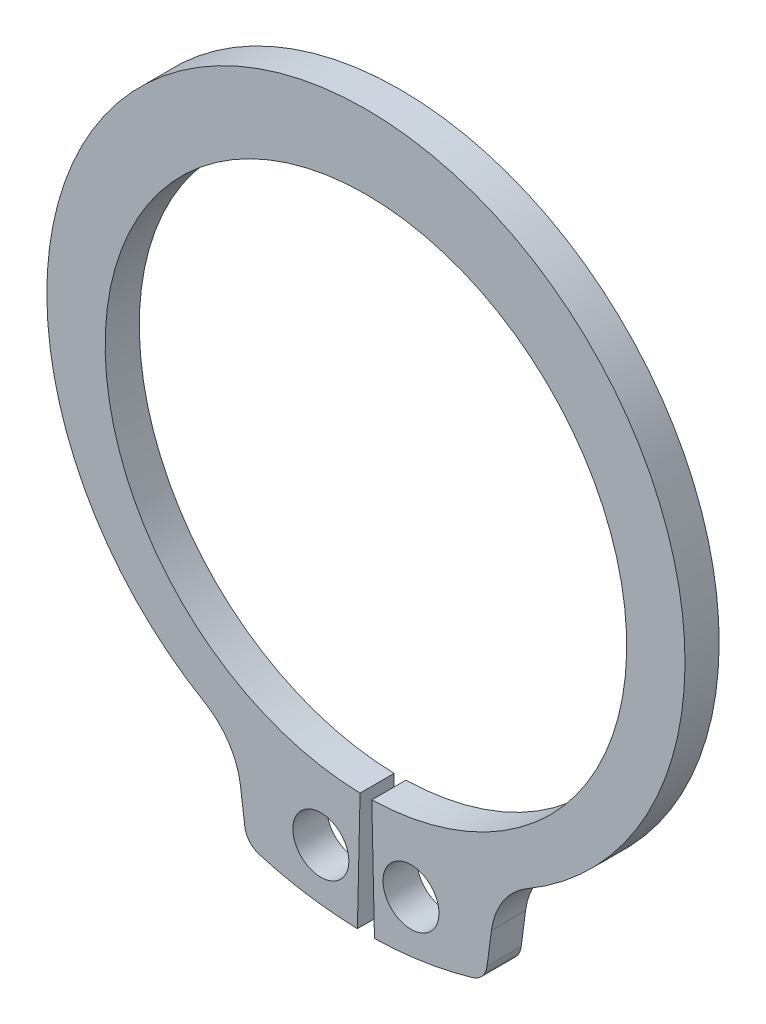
ISO-10303-21;
HEADER;
FILE_DESCRIPTION(('STEP AP214'),'2;1');
FILE_NAME('part.step','',(''),(''),'','','');
FILE_SCHEMA(('AUTOMOTIVE_DESIGN { 1 0 10303 214 1 1 1 1 }'));
ENDSEC;
DATA;
#1=APPLICATION_CONTEXT('core data for automotive mechanical design processes');
#2=APPLICATION_PROTOCOL_DEFINITION('international standard','automotive_design',2000,#1);
#3=PRODUCT_CONTEXT('',#1,'mechanical');
#4=PRODUCT('Part','Part','',(#3));
#5=PRODUCT_RELATED_PRODUCT_CATEGORY('part','',(#4));
#6=PRODUCT_DEFINITION_FORMATION('','',#4);
#7=PRODUCT_DEFINITION_CONTEXT('part definition',#1,'design');
#8=PRODUCT_DEFINITION('design','',#6,#7);
#9=PRODUCT_DEFINITION_SHAPE('','',#8);
#10=(LENGTH_UNIT() NAMED_UNIT(*) SI_UNIT(.MILLI.,.METRE.));
#11=(NAMED_UNIT(*) PLANE_ANGLE_UNIT() SI_UNIT($,.RADIAN.));
#12=(NAMED_UNIT(*) SI_UNIT($,.STERADIAN.) SOLID_ANGLE_UNIT());
#13=UNCERTAINTY_MEASURE_WITH_UNIT(LENGTH_MEASURE(1.E-05),#10,'distance_accuracy_value','');
#14=(GEOMETRIC_REPRESENTATION_CONTEXT(3) GLOBAL_UNCERTAINTY_ASSIGNED_CONTEXT((#13)) GLOBAL_UNIT_ASSIGNED_CONTEXT((#10,
#11,#12)) REPRESENTATION_CONTEXT('',''));
#15=CARTESIAN_POINT('',(0.,0.,0.));
#16=DIRECTION('',(0.,0.,1.));
#17=DIRECTION('',(1.,0.,0.));
#18=AXIS2_PLACEMENT_3D('',#15,#16,#17);
#19=CARTESIAN_POINT('',(0.,0.,-0.635));
#20=DIRECTION('',(0.,0.,1.));
#21=DIRECTION('',(1.,0.,0.));
#22=AXIS2_PLACEMENT_3D('',#19,#20,#21);
#23=CYLINDRICAL_SURFACE('',#22,4.8514);
#24=CARTESIAN_POINT('',(0.,0.,0.));
#25=DIRECTION('',(0.,0.,-1.));
#26=DIRECTION('',(1.,0.,0.));
#27=AXIS2_PLACEMENT_3D('',#24,#25,#26);
#28=CIRCLE('',#27,4.8514);
#29=CARTESIAN_POINT('',(-0.109069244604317,-4.85017379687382,0.));
#30=VERTEX_POINT('',#29);
#31=CARTESIAN_POINT('',(0.109069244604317,-4.85017379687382,0.));
#32=VERTEX_POINT('',#31);
#33=EDGE_CURVE('E151',#30,#32,#28,.T.);
#34=ORIENTED_EDGE('',*,*,#33,.F.);
#35=DIRECTION('',(0.,0.,1.));
#36=VECTOR('',#35,1.);
#37=CARTESIAN_POINT('',(-0.109069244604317,-4.85017379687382,-0.635));
#38=LINE('',#37,#36);
#39=CARTESIAN_POINT('',(-0.109069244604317,-4.85017379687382,-0.635));
#40=VERTEX_POINT('',#39);
#41=EDGE_CURVE('E11',#40,#30,#38,.T.);
#42=ORIENTED_EDGE('',*,*,#41,.F.);
#43=CARTESIAN_POINT('',(0.,0.,-0.635));
#44=DIRECTION('',(0.,0.,-1.));
#45=DIRECTION('',(1.,0.,0.));
#46=AXIS2_PLACEMENT_3D('',#43,#44,#45);
#47=CIRCLE('',#46,4.8514);
#48=CARTESIAN_POINT('',(0.109069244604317,-4.85017379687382,-0.635));
#49=VERTEX_POINT('',#48);
#50=EDGE_CURVE('E184',#40,#49,#47,.T.);
#51=ORIENTED_EDGE('',*,*,#50,.T.);
#52=DIRECTION('',(0.,0.,1.));
#53=VECTOR('',#52,1.);
#54=CARTESIAN_POINT('',(0.109069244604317,-4.85017379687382,-0.635));
#55=LINE('',#54,#53);
#56=EDGE_CURVE('E33',#49,#32,#55,.T.);
#57=ORIENTED_EDGE('',*,*,#56,.T.);
#58=EDGE_LOOP('',(#34,#42,#51,#57));
#59=FACE_BOUND('',#58,.T.);
#60=ADVANCED_FACE('F30',(#59),#23,.F.);
#61=CARTESIAN_POINT('',(-0.109069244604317,-4.85017379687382,-0.635));
#62=DIRECTION('',(0.999747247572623,-0.0224820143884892,0.));
#63=DIRECTION('',(0.0224820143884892,0.999747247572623,0.));
#64=AXIS2_PLACEMENT_3D('',#61,#62,#63);
#65=PLANE('',#64);
#66=DIRECTION('',(0.0224820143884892,0.999747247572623,0.));
#67=VECTOR('',#66,1.);
#68=CARTESIAN_POINT('',(-0.109069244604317,-4.85017379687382,0.));
#69=LINE('',#68,#67);
#70=CARTESIAN_POINT('',(-0.15875,-7.05941526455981,0.));
#71=VERTEX_POINT('',#70);
#72=EDGE_CURVE('E182',#71,#30,#69,.T.);
#73=ORIENTED_EDGE('',*,*,#72,.F.);
#74=DIRECTION('',(0.,0.,1.));
#75=VECTOR('',#74,1.);
#76=CARTESIAN_POINT('',(-0.15875,-7.05941526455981,-0.635));
#77=LINE('',#76,#75);
#78=CARTESIAN_POINT('',(-0.15875,-7.05941526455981,-0.635));
#79=VERTEX_POINT('',#78);
#80=EDGE_CURVE('E39',#79,#71,#77,.T.);
#81=ORIENTED_EDGE('',*,*,#80,.F.);
#82=DIRECTION('',(0.0224820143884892,0.999747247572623,0.));
#83=VECTOR('',#82,1.);
#84=CARTESIAN_POINT('',(-0.109069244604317,-4.85017379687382,-0.635));
#85=LINE('',#84,#83);
#86=EDGE_CURVE('E141',#79,#40,#85,.T.);
#87=ORIENTED_EDGE('',*,*,#86,.T.);
#88=ORIENTED_EDGE('',*,*,#41,.T.);
#89=EDGE_LOOP('',(#73,#81,#87,#88));
#90=FACE_BOUND('',#89,.T.);
#91=ADVANCED_FACE('F204',(#90),#65,.T.);
#92=CARTESIAN_POINT('',(0.,0.,-0.635));
#93=DIRECTION('',(0.,0.,1.));
#94=DIRECTION('',(1.,0.,0.));
#95=AXIS2_PLACEMENT_3D('',#92,#93,#94);
#96=CYLINDRICAL_SURFACE('',#95,7.0612);
#97=CARTESIAN_POINT('',(0.,0.,0.));
#98=DIRECTION('',(0.,0.,1.));
#99=DIRECTION('',(1.,0.,0.));
#100=AXIS2_PLACEMENT_3D('',#97,#98,#99);
#101=CIRCLE('',#100,7.0612);
#102=CARTESIAN_POINT('',(-1.98208790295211,-6.77730573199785,0.));
#103=VERTEX_POINT('',#102);
#104=EDGE_CURVE('E128',#103,#71,#101,.T.);
#105=ORIENTED_EDGE('',*,*,#104,.F.);
#106=DIRECTION('',(0.,0.,1.));
#107=VECTOR('',#106,1.);
#108=CARTESIAN_POINT('',(-1.98208790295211,-6.77730573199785,-0.635));
#109=LINE('',#108,#107);
#110=CARTESIAN_POINT('',(-1.98208790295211,-6.77730573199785,-0.635));
#111=VERTEX_POINT('',#110);
#112=EDGE_CURVE('E123',#111,#103,#109,.T.);
#113=ORIENTED_EDGE('',*,*,#112,.F.);
#114=CARTESIAN_POINT('',(0.,0.,-0.635));
#115=DIRECTION('',(0.,0.,1.));
#116=DIRECTION('',(1.,0.,0.));
#117=AXIS2_PLACEMENT_3D('',#114,#115,#116);
#118=CIRCLE('',#117,7.0612);
#119=EDGE_CURVE('E126',#111,#79,#118,.T.);
#120=ORIENTED_EDGE('',*,*,#119,.T.);
#121=ORIENTED_EDGE('',*,*,#80,.T.);
#122=EDGE_LOOP('',(#105,#113,#120,#121));
#123=FACE_BOUND('',#122,.T.);
#124=ADVANCED_FACE('F125',(#123),#96,.T.);
#125=CARTESIAN_POINT('',(-1.8751407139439,-6.41162376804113,-0.635));
#126=DIRECTION('',(0.,0.,1.));
#127=DIRECTION('',(1.,0.,0.));
#128=AXIS2_PLACEMENT_3D('',#125,#126,#127);
#129=CYLINDRICAL_SURFACE('',#128,0.380999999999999);
#130=CARTESIAN_POINT('',(-1.8751407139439,-6.41162376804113,0.));
#131=DIRECTION('',(0.,0.,1.));
#132=DIRECTION('',(1.,0.,0.));
#133=AXIS2_PLACEMENT_3D('',#130,#131,#132);
#134=CIRCLE('',#133,0.380999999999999);
#135=CARTESIAN_POINT('',(-2.25288120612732,-6.46135424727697,0.));
#136=VERTEX_POINT('',#135);
#137=EDGE_CURVE('E179',#136,#103,#134,.T.);
#138=ORIENTED_EDGE('',*,*,#137,.F.);
#139=DIRECTION('',(0.,0.,1.));
#140=VECTOR('',#139,1.);
#141=CARTESIAN_POINT('',(-2.25288120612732,-6.46135424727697,-0.635));
#142=LINE('',#141,#140);
#143=CARTESIAN_POINT('',(-2.25288120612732,-6.46135424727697,-0.635));
#144=VERTEX_POINT('',#143);
#145=EDGE_CURVE('E133',#144,#136,#142,.T.);
#146=ORIENTED_EDGE('',*,*,#145,.F.);
#147=CARTESIAN_POINT('',(-1.8751407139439,-6.41162376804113,-0.635));
#148=DIRECTION('',(0.,0.,1.));
#149=DIRECTION('',(1.,0.,0.));
#150=AXIS2_PLACEMENT_3D('',#147,#148,#149);
#151=CIRCLE('',#150,0.380999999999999);
#152=EDGE_CURVE('E139',#144,#111,#151,.T.);
#153=ORIENTED_EDGE('',*,*,#152,.T.);
#154=ORIENTED_EDGE('',*,*,#112,.T.);
#155=EDGE_LOOP('',(#138,#146,#153,#154));
#156=FACE_BOUND('',#155,.T.);
#157=ADVANCED_FACE('F143',(#156),#129,.T.);
#158=CARTESIAN_POINT('',(-2.33485897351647,-5.83867128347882,-0.635));
#159=DIRECTION('',(-0.99144486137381,-0.130526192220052,0.));
#160=DIRECTION('',(0.130526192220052,-0.99144486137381,0.));
#161=AXIS2_PLACEMENT_3D('',#158,#159,#160);
#162=PLANE('',#161);
#163=DIRECTION('',(0.130526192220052,-0.99144486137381,0.));
#164=VECTOR('',#163,1.);
#165=CARTESIAN_POINT('',(-2.33485897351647,-5.83867128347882,0.));
#166=LINE('',#165,#164);
#167=CARTESIAN_POINT('',(-2.33485897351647,-5.83867128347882,0.));
#168=VERTEX_POINT('',#167);
#169=EDGE_CURVE('E176',#168,#136,#166,.T.);
#170=ORIENTED_EDGE('',*,*,#169,.F.);
#171=DIRECTION('',(0.,0.,1.));
#172=VECTOR('',#171,1.);
#173=CARTESIAN_POINT('',(-2.33485897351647,-5.83867128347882,-0.635));
#174=LINE('',#173,#172);
#175=CARTESIAN_POINT('',(-2.33485897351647,-5.83867128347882,-0.635));
#176=VERTEX_POINT('',#175);
#177=EDGE_CURVE('E188',#176,#168,#174,.T.);
#178=ORIENTED_EDGE('',*,*,#177,.F.);
#179=DIRECTION('',(0.130526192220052,-0.99144486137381,0.));
#180=VECTOR('',#179,1.);
#181=CARTESIAN_POINT('',(-2.33485897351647,-5.83867128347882,-0.635));
#182=LINE('',#181,#180);
#183=EDGE_CURVE('E144',#176,#144,#182,.T.);
#184=ORIENTED_EDGE('',*,*,#183,.T.);
#185=ORIENTED_EDGE('',*,*,#145,.T.);
#186=EDGE_LOOP('',(#170,#178,#184,#185));
#187=FACE_BOUND('',#186,.T.);
#188=ADVANCED_FACE('F217',(#187),#162,.T.);
#189=CARTESIAN_POINT('',(-3.6943713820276,-6.01765448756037,-0.635));
#190=DIRECTION('',(0.,0.,1.));
#191=DIRECTION('',(1.,0.,0.));
#192=AXIS2_PLACEMENT_3D('',#189,#190,#191);
#193=CYLINDRICAL_SURFACE('',#192,1.37124358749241);
#194=CARTESIAN_POINT('',(-3.6943713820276,-6.01765448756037,0.));
#195=DIRECTION('',(0.,0.,-1.));
#196=DIRECTION('',(1.,0.,0.));
#197=AXIS2_PLACEMENT_3D('',#194,#195,#196);
#198=CIRCLE('',#197,1.37124358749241);
#199=CARTESIAN_POINT('',(-3.00110702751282,-4.83456805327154,0.));
#200=VERTEX_POINT('',#199);
#201=EDGE_CURVE('E173',#200,#168,#198,.T.);
#202=ORIENTED_EDGE('',*,*,#201,.F.);
#203=DIRECTION('',(0.,0.,1.));
#204=VECTOR('',#203,1.);
#205=CARTESIAN_POINT('',(-3.00110702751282,-4.83456805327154,-0.635));
#206=LINE('',#205,#204);
#207=CARTESIAN_POINT('',(-3.00110702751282,-4.83456805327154,-0.635));
#208=VERTEX_POINT('',#207);
#209=EDGE_CURVE('E190',#208,#200,#206,.T.);
#210=ORIENTED_EDGE('',*,*,#209,.F.);
#211=CARTESIAN_POINT('',(-3.6943713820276,-6.01765448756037,-0.635));
#212=DIRECTION('',(0.,0.,-1.));
#213=DIRECTION('',(1.,0.,0.));
#214=AXIS2_PLACEMENT_3D('',#211,#212,#213);
#215=CIRCLE('',#214,1.37124358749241);
#216=EDGE_CURVE('E146',#208,#176,#215,.T.);
#217=ORIENTED_EDGE('',*,*,#216,.T.);
#218=ORIENTED_EDGE('',*,*,#177,.T.);
#219=EDGE_LOOP('',(#202,#210,#217,#218));
#220=FACE_BOUND('',#219,.T.);
#221=ADVANCED_FACE('F220',(#220),#193,.F.);
#222=CARTESIAN_POINT('',(0.,0.286954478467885,-0.635));
#223=DIRECTION('',(0.,0.,1.));
#224=DIRECTION('',(1.,0.,0.));
#225=AXIS2_PLACEMENT_3D('',#222,#223,#224);
#226=CYLINDRICAL_SURFACE('',#225,5.93604552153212);
#227=CARTESIAN_POINT('',(0.,0.286954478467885,0.));
#228=DIRECTION('',(0.,0.,1.));
#229=DIRECTION('',(1.,0.,0.));
#230=AXIS2_PLACEMENT_3D('',#227,#228,#229);
#231=CIRCLE('',#230,5.93604552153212);
#232=CARTESIAN_POINT('',(3.00110702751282,-4.83456805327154,0.));
#233=VERTEX_POINT('',#232);
#234=EDGE_CURVE('E170',#233,#200,#231,.T.);
#235=ORIENTED_EDGE('',*,*,#234,.F.);
#236=DIRECTION('',(0.,0.,1.));
#237=VECTOR('',#236,1.);
#238=CARTESIAN_POINT('',(3.00110702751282,-4.83456805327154,-0.635));
#239=LINE('',#238,#237);
#240=CARTESIAN_POINT('',(3.00110702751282,-4.83456805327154,-0.635));
#241=VERTEX_POINT('',#240);
#242=EDGE_CURVE('E192',#241,#233,#239,.T.);
#243=ORIENTED_EDGE('',*,*,#242,.F.);
#244=CARTESIAN_POINT('',(0.,0.286954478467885,-0.635));
#245=DIRECTION('',(0.,0.,1.));
#246=DIRECTION('',(1.,0.,0.));
#247=AXIS2_PLACEMENT_3D('',#244,#245,#246);
#248=CIRCLE('',#247,5.93604552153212);
#249=EDGE_CURVE('E294',#241,#208,#248,.T.);
#250=ORIENTED_EDGE('',*,*,#249,.T.);
#251=ORIENTED_EDGE('',*,*,#209,.T.);
#252=EDGE_LOOP('',(#235,#243,#250,#251));
#253=FACE_BOUND('',#252,.T.);
#254=ADVANCED_FACE('F224',(#253),#226,.T.);
#255=CARTESIAN_POINT('',(3.6943713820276,-6.01765448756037,-0.635));
#256=DIRECTION('',(0.,0.,1.));
#257=DIRECTION('',(1.,0.,0.));
#258=AXIS2_PLACEMENT_3D('',#255,#256,#257);
#259=CYLINDRICAL_SURFACE('',#258,1.37124358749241);
#260=CARTESIAN_POINT('',(3.6943713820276,-6.01765448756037,0.));
#261=DIRECTION('',(0.,0.,-1.));
#262=DIRECTION('',(1.,0.,0.));
#263=AXIS2_PLACEMENT_3D('',#260,#261,#262);
#264=CIRCLE('',#263,1.37124358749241);
#265=CARTESIAN_POINT('',(2.33485897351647,-5.83867128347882,0.));
#266=VERTEX_POINT('',#265);
#267=EDGE_CURVE('E167',#266,#233,#264,.T.);
#268=ORIENTED_EDGE('',*,*,#267,.F.);
#269=DIRECTION('',(0.,0.,1.));
#270=VECTOR('',#269,1.);
#271=CARTESIAN_POINT('',(2.33485897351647,-5.83867128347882,-0.635));
#272=LINE('',#271,#270);
#273=CARTESIAN_POINT('',(2.33485897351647,-5.83867128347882,-0.635));
#274=VERTEX_POINT('',#273);
#275=EDGE_CURVE('E194',#274,#266,#272,.T.);
#276=ORIENTED_EDGE('',*,*,#275,.F.);
#277=CARTESIAN_POINT('',(3.6943713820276,-6.01765448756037,-0.635));
#278=DIRECTION('',(0.,0.,-1.));
#279=DIRECTION('',(1.,0.,0.));
#280=AXIS2_PLACEMENT_3D('',#277,#278,#279);
#281=CIRCLE('',#280,1.37124358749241);
#282=EDGE_CURVE('E291',#274,#241,#281,.T.);
#283=ORIENTED_EDGE('',*,*,#282,.T.);
#284=ORIENTED_EDGE('',*,*,#242,.T.);
#285=EDGE_LOOP('',(#268,#276,#283,#284));
#286=FACE_BOUND('',#285,.T.);
#287=ADVANCED_FACE('F228',(#286),#259,.F.);
#288=CARTESIAN_POINT('',(2.33485897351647,-5.83867128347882,-0.635));
#289=DIRECTION('',(0.99144486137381,-0.130526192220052,0.));
#290=DIRECTION('',(0.130526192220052,0.99144486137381,0.));
#291=AXIS2_PLACEMENT_3D('',#288,#289,#290);
#292=PLANE('',#291);
#293=DIRECTION('',(0.130526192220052,0.99144486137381,0.));
#294=VECTOR('',#293,1.);
#295=CARTESIAN_POINT('',(2.33485897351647,-5.83867128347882,0.));
#296=LINE('',#295,#294);
#297=CARTESIAN_POINT('',(2.25288120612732,-6.46135424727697,0.));
#298=VERTEX_POINT('',#297);
#299=EDGE_CURVE('E164',#298,#266,#296,.T.);
#300=ORIENTED_EDGE('',*,*,#299,.F.);
#301=DIRECTION('',(0.,0.,1.));
#302=VECTOR('',#301,1.);
#303=CARTESIAN_POINT('',(2.25288120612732,-6.46135424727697,-0.635));
#304=LINE('',#303,#302);
#305=CARTESIAN_POINT('',(2.25288120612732,-6.46135424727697,-0.635));
#306=VERTEX_POINT('',#305);
#307=EDGE_CURVE('E196',#306,#298,#304,.T.);
#308=ORIENTED_EDGE('',*,*,#307,.F.);
#309=DIRECTION('',(0.130526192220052,0.99144486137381,0.));
#310=VECTOR('',#309,1.);
#311=CARTESIAN_POINT('',(2.33485897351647,-5.83867128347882,-0.635));
#312=LINE('',#311,#310);
#313=EDGE_CURVE('E288',#306,#274,#312,.T.);
#314=ORIENTED_EDGE('',*,*,#313,.T.);
#315=ORIENTED_EDGE('',*,*,#275,.T.);
#316=EDGE_LOOP('',(#300,#308,#314,#315));
#317=FACE_BOUND('',#316,.T.);
#318=ADVANCED_FACE('F232',(#317),#292,.T.);
#319=CARTESIAN_POINT('',(1.8751407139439,-6.41162376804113,-0.635));
#320=DIRECTION('',(0.,0.,1.));
#321=DIRECTION('',(1.,0.,0.));
#322=AXIS2_PLACEMENT_3D('',#319,#320,#321);
#323=CYLINDRICAL_SURFACE('',#322,0.380999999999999);
#324=CARTESIAN_POINT('',(1.8751407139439,-6.41162376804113,0.));
#325=DIRECTION('',(0.,0.,1.));
#326=DIRECTION('',(-1.,0.,0.));
#327=AXIS2_PLACEMENT_3D('',#324,#325,#326);
#328=CIRCLE('',#327,0.380999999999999);
#329=CARTESIAN_POINT('',(1.98208790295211,-6.77730573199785,0.));
#330=VERTEX_POINT('',#329);
#331=EDGE_CURVE('E161',#330,#298,#328,.T.);
#332=ORIENTED_EDGE('',*,*,#331,.F.);
#333=DIRECTION('',(0.,0.,1.));
#334=VECTOR('',#333,1.);
#335=CARTESIAN_POINT('',(1.98208790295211,-6.77730573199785,-0.635));
#336=LINE('',#335,#334);
#337=CARTESIAN_POINT('',(1.98208790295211,-6.77730573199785,-0.635));
#338=VERTEX_POINT('',#337);
#339=EDGE_CURVE('E198',#338,#330,#336,.T.);
#340=ORIENTED_EDGE('',*,*,#339,.F.);
#341=CARTESIAN_POINT('',(1.8751407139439,-6.41162376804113,-0.635));
#342=DIRECTION('',(0.,0.,1.));
#343=DIRECTION('',(-1.,0.,0.));
#344=AXIS2_PLACEMENT_3D('',#341,#342,#343);
#345=CIRCLE('',#344,0.380999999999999);
#346=EDGE_CURVE('E285',#338,#306,#345,.T.);
#347=ORIENTED_EDGE('',*,*,#346,.T.);
#348=ORIENTED_EDGE('',*,*,#307,.T.);
#349=EDGE_LOOP('',(#332,#340,#347,#348));
#350=FACE_BOUND('',#349,.T.);
#351=ADVANCED_FACE('F236',(#350),#323,.T.);
#352=CARTESIAN_POINT('',(0.,0.,-0.635));
#353=DIRECTION('',(0.,0.,1.));
#354=DIRECTION('',(1.,0.,0.));
#355=AXIS2_PLACEMENT_3D('',#352,#353,#354);
#356=CYLINDRICAL_SURFACE('',#355,7.0612);
#357=CARTESIAN_POINT('',(0.,0.,0.));
#358=DIRECTION('',(0.,0.,1.));
#359=DIRECTION('',(1.,0.,0.));
#360=AXIS2_PLACEMENT_3D('',#357,#358,#359);
#361=CIRCLE('',#360,7.0612);
#362=CARTESIAN_POINT('',(0.158749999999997,-7.05941526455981,0.));
#363=VERTEX_POINT('',#362);
#364=EDGE_CURVE('E158',#363,#330,#361,.T.);
#365=ORIENTED_EDGE('',*,*,#364,.F.);
#366=DIRECTION('',(0.,0.,1.));
#367=VECTOR('',#366,1.);
#368=CARTESIAN_POINT('',(0.158749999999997,-7.05941526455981,-0.635));
#369=LINE('',#368,#367);
#370=CARTESIAN_POINT('',(0.158749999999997,-7.05941526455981,-0.635));
#371=VERTEX_POINT('',#370);
#372=EDGE_CURVE('E199',#371,#363,#369,.T.);
#373=ORIENTED_EDGE('',*,*,#372,.F.);
#374=CARTESIAN_POINT('',(0.,0.,-0.635));
#375=DIRECTION('',(0.,0.,1.));
#376=DIRECTION('',(1.,0.,0.));
#377=AXIS2_PLACEMENT_3D('',#374,#375,#376);
#378=CIRCLE('',#377,7.0612);
#379=EDGE_CURVE('E282',#371,#338,#378,.T.);
#380=ORIENTED_EDGE('',*,*,#379,.T.);
#381=ORIENTED_EDGE('',*,*,#339,.T.);
#382=EDGE_LOOP('',(#365,#373,#380,#381));
#383=FACE_BOUND('',#382,.T.);
#384=ADVANCED_FACE('F240',(#383),#356,.T.);
#385=CARTESIAN_POINT('',(0.109069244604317,-4.85017379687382,-0.635));
#386=DIRECTION('',(-0.999747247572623,-0.0224820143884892,0.));
#387=DIRECTION('',(0.0224820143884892,-0.999747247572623,0.));
#388=AXIS2_PLACEMENT_3D('',#385,#386,#387);
#389=PLANE('',#388);
#390=DIRECTION('',(0.0224820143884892,-0.999747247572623,0.));
#391=VECTOR('',#390,1.);
#392=CARTESIAN_POINT('',(0.109069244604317,-4.85017379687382,0.));
#393=LINE('',#392,#391);
#394=EDGE_CURVE('E154',#32,#363,#393,.T.);
#395=ORIENTED_EDGE('',*,*,#394,.F.);
#396=ORIENTED_EDGE('',*,*,#56,.F.);
#397=DIRECTION('',(0.0224820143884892,-0.999747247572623,0.));
#398=VECTOR('',#397,1.);
#399=CARTESIAN_POINT('',(0.109069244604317,-4.85017379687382,-0.635));
#400=LINE('',#399,#398);
#401=EDGE_CURVE('E280',#49,#371,#400,.T.);
#402=ORIENTED_EDGE('',*,*,#401,.T.);
#403=ORIENTED_EDGE('',*,*,#372,.T.);
#404=EDGE_LOOP('',(#395,#396,#402,#403));
#405=FACE_BOUND('',#404,.T.);
#406=ADVANCED_FACE('F201',(#405),#389,.T.);
#407=CARTESIAN_POINT('',(0.,0.,-0.635));
#408=DIRECTION('',(0.,0.,1.));
#409=DIRECTION('',(1.,0.,0.));
#410=AXIS2_PLACEMENT_3D('',#407,#408,#409);
#411=PLANE('',#410);
#412=CARTESIAN_POINT('',(-0.8382,-6.05092029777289,-0.635));
#413=DIRECTION('',(0.,0.,1.));
#414=DIRECTION('',(1.,0.,0.));
#415=AXIS2_PLACEMENT_3D('',#412,#413,#414);
#416=CIRCLE('',#415,0.5207);
#417=CARTESIAN_POINT('',(-0.3175,-6.05092029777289,-0.635));
#418=VERTEX_POINT('',#417);
#419=EDGE_CURVE('E267',#418,#418,#416,.T.);
#420=ORIENTED_EDGE('',*,*,#419,.T.);
#421=EDGE_LOOP('',(#420));
#422=FACE_BOUND('',#421,.T.);
#423=CARTESIAN_POINT('',(0.8382,-6.05092029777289,-0.635));
#424=DIRECTION('',(0.,0.,1.));
#425=DIRECTION('',(1.,0.,0.));
#426=AXIS2_PLACEMENT_3D('',#423,#424,#425);
#427=CIRCLE('',#426,0.5207);
#428=CARTESIAN_POINT('',(1.3589,-6.05092029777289,-0.635));
#429=VERTEX_POINT('',#428);
#430=EDGE_CURVE('E155',#429,#429,#427,.T.);
#431=ORIENTED_EDGE('',*,*,#430,.T.);
#432=EDGE_LOOP('',(#431));
#433=FACE_BOUND('',#432,.T.);
#434=ORIENTED_EDGE('',*,*,#50,.F.);
#435=ORIENTED_EDGE('',*,*,#86,.F.);
#436=ORIENTED_EDGE('',*,*,#119,.F.);
#437=ORIENTED_EDGE('',*,*,#152,.F.);
#438=ORIENTED_EDGE('',*,*,#183,.F.);
#439=ORIENTED_EDGE('',*,*,#216,.F.);
#440=ORIENTED_EDGE('',*,*,#249,.F.);
#441=ORIENTED_EDGE('',*,*,#282,.F.);
#442=ORIENTED_EDGE('',*,*,#313,.F.);
#443=ORIENTED_EDGE('',*,*,#346,.F.);
#444=ORIENTED_EDGE('',*,*,#379,.F.);
#445=ORIENTED_EDGE('',*,*,#401,.F.);
#446=EDGE_LOOP('',(#434,#435,#436,#437,#438,#439,#440,#441,#442,#443,#444,#445));
#447=FACE_BOUND('',#446,.T.);
#448=ADVANCED_FACE('F137',(#422,#433,#447),#411,.F.);
#449=CARTESIAN_POINT('',(0.,0.,0.));
#450=DIRECTION('',(0.,0.,1.));
#451=DIRECTION('',(1.,0.,0.));
#452=AXIS2_PLACEMENT_3D('',#449,#450,#451);
#453=PLANE('',#452);
#454=CARTESIAN_POINT('',(-0.8382,-6.05092029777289,0.));
#455=DIRECTION('',(0.,0.,1.));
#456=DIRECTION('',(1.,0.,0.));
#457=AXIS2_PLACEMENT_3D('',#454,#455,#456);
#458=CIRCLE('',#457,0.5207);
#459=CARTESIAN_POINT('',(-0.3175,-6.05092029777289,0.));
#460=VERTEX_POINT('',#459);
#461=EDGE_CURVE('E270',#460,#460,#458,.T.);
#462=ORIENTED_EDGE('',*,*,#461,.F.);
#463=EDGE_LOOP('',(#462));
#464=FACE_BOUND('',#463,.T.);
#465=CARTESIAN_POINT('',(0.8382,-6.05092029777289,0.));
#466=DIRECTION('',(0.,0.,1.));
#467=DIRECTION('',(1.,0.,0.));
#468=AXIS2_PLACEMENT_3D('',#465,#466,#467);
#469=CIRCLE('',#468,0.5207);
#470=CARTESIAN_POINT('',(1.3589,-6.05092029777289,0.));
#471=VERTEX_POINT('',#470);
#472=EDGE_CURVE('E272',#471,#471,#469,.T.);
#473=ORIENTED_EDGE('',*,*,#472,.F.);
#474=EDGE_LOOP('',(#473));
#475=FACE_BOUND('',#474,.T.);
#476=ORIENTED_EDGE('',*,*,#33,.T.);
#477=ORIENTED_EDGE('',*,*,#394,.T.);
#478=ORIENTED_EDGE('',*,*,#364,.T.);
#479=ORIENTED_EDGE('',*,*,#331,.T.);
#480=ORIENTED_EDGE('',*,*,#299,.T.);
#481=ORIENTED_EDGE('',*,*,#267,.T.);
#482=ORIENTED_EDGE('',*,*,#234,.T.);
#483=ORIENTED_EDGE('',*,*,#201,.T.);
#484=ORIENTED_EDGE('',*,*,#169,.T.);
#485=ORIENTED_EDGE('',*,*,#137,.T.);
#486=ORIENTED_EDGE('',*,*,#104,.T.);
#487=ORIENTED_EDGE('',*,*,#72,.T.);
#488=EDGE_LOOP('',(#476,#477,#478,#479,#480,#481,#482,#483,#484,#485,#486,#487));
#489=FACE_BOUND('',#488,.T.);
#490=ADVANCED_FACE('F203',(#464,#475,#489),#453,.T.);
#491=CARTESIAN_POINT('',(0.8382,-6.05092029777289,-0.635));
#492=DIRECTION('',(0.,0.,1.));
#493=DIRECTION('',(1.,0.,0.));
#494=AXIS2_PLACEMENT_3D('',#491,#492,#493);
#495=CYLINDRICAL_SURFACE('',#494,0.5207);
#496=ORIENTED_EDGE('',*,*,#430,.F.);
#497=EDGE_LOOP('',(#496));
#498=FACE_BOUND('',#497,.T.);
#499=ORIENTED_EDGE('',*,*,#472,.T.);
#500=EDGE_LOOP('',(#499));
#501=FACE_BOUND('',#500,.T.);
#502=ADVANCED_FACE('F252',(#498,#501),#495,.F.);
#503=CARTESIAN_POINT('',(-0.8382,-6.05092029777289,-0.635));
#504=DIRECTION('',(0.,0.,1.));
#505=DIRECTION('',(1.,0.,0.));
#506=AXIS2_PLACEMENT_3D('',#503,#504,#505);
#507=CYLINDRICAL_SURFACE('',#506,0.5207);
#508=ORIENTED_EDGE('',*,*,#419,.F.);
#509=EDGE_LOOP('',(#508));
#510=FACE_BOUND('',#509,.T.);
#511=ORIENTED_EDGE('',*,*,#461,.T.);
#512=EDGE_LOOP('',(#511));
#513=FACE_BOUND('',#512,.T.);
#514=ADVANCED_FACE('F259',(#510,#513),#507,.F.);
#515=CLOSED_SHELL('',(#60,#91,#124,#157,#188,#221,#254,#287,#318,#351,#384,#406,#448,#490,#502,#514));
#516=MANIFOLD_SOLID_BREP('B2',#515);
#517=ADVANCED_BREP_SHAPE_REPRESENTATION('',(#18,#516),#14);
#518=SHAPE_DEFINITION_REPRESENTATION(#9,#517);
ENDSEC;
END-ISO-10303-21;
